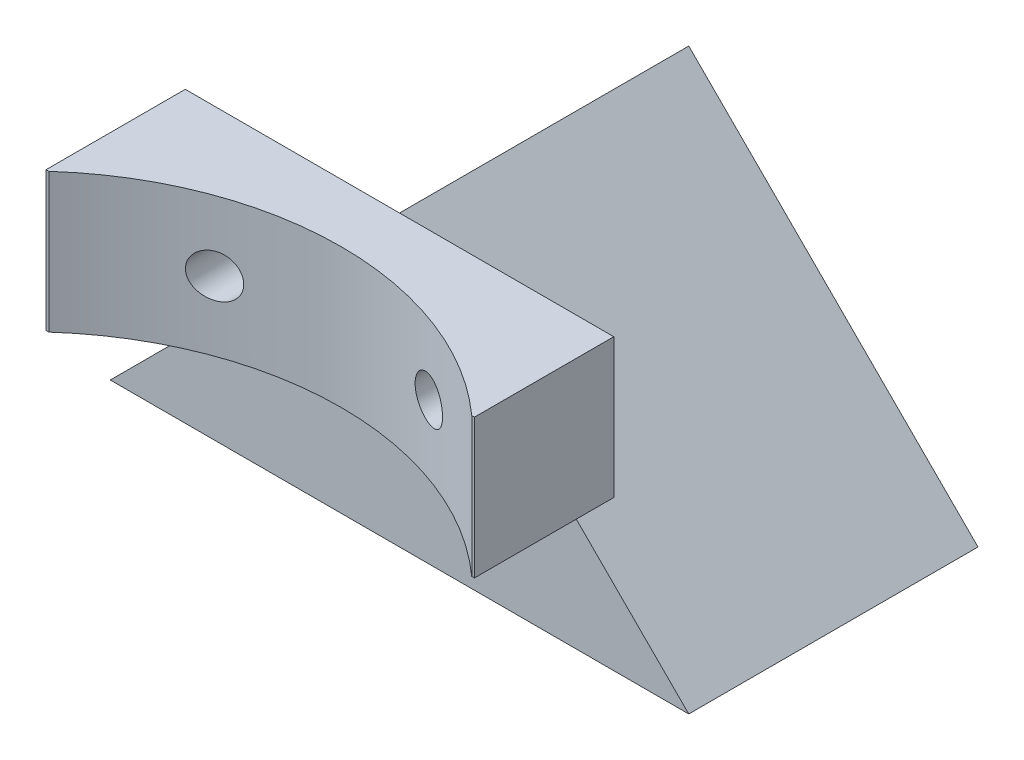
ISO-10303-21;
HEADER;
FILE_DESCRIPTION(('STEP AP214'),'2;1');
FILE_NAME('part.step','',(''),(''),'','','');
FILE_SCHEMA(('AUTOMOTIVE_DESIGN { 1 0 10303 214 1 1 1 1 }'));
ENDSEC;
DATA;
#1=APPLICATION_CONTEXT('core data for automotive mechanical design processes');
#2=APPLICATION_PROTOCOL_DEFINITION('international standard','automotive_design',2000,#1);
#3=PRODUCT_CONTEXT('',#1,'mechanical');
#4=PRODUCT('Part','Part','',(#3));
#5=PRODUCT_RELATED_PRODUCT_CATEGORY('part','',(#4));
#6=PRODUCT_DEFINITION_FORMATION('','',#4);
#7=PRODUCT_DEFINITION_CONTEXT('part definition',#1,'design');
#8=PRODUCT_DEFINITION('design','',#6,#7);
#9=PRODUCT_DEFINITION_SHAPE('','',#8);
#10=(LENGTH_UNIT() NAMED_UNIT(*) SI_UNIT(.MILLI.,.METRE.));
#11=(NAMED_UNIT(*) PLANE_ANGLE_UNIT() SI_UNIT($,.RADIAN.));
#12=(NAMED_UNIT(*) SI_UNIT($,.STERADIAN.) SOLID_ANGLE_UNIT());
#13=UNCERTAINTY_MEASURE_WITH_UNIT(LENGTH_MEASURE(1.E-05),#10,'distance_accuracy_value','');
#14=(GEOMETRIC_REPRESENTATION_CONTEXT(3) GLOBAL_UNCERTAINTY_ASSIGNED_CONTEXT((#13)) GLOBAL_UNIT_ASSIGNED_CONTEXT((#10,
#11,#12)) REPRESENTATION_CONTEXT('',''));
#15=CARTESIAN_POINT('',(0.,0.,0.));
#16=DIRECTION('',(0.,0.,1.));
#17=DIRECTION('',(1.,0.,0.));
#18=AXIS2_PLACEMENT_3D('',#15,#16,#17);
#19=CARTESIAN_POINT('',(0.,0.,40.));
#20=DIRECTION('',(0.,0.,1.));
#21=DIRECTION('',(1.,0.,0.));
#22=AXIS2_PLACEMENT_3D('',#19,#20,#21);
#23=PLANE('',#22);
#24=DIRECTION('',(0.,1.,0.));
#25=VECTOR('',#24,1.);
#26=CARTESIAN_POINT('',(15.9658598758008,-3.2664301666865,40.));
#27=LINE('',#26,#25);
#28=CARTESIAN_POINT('',(15.9658598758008,4.7335698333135,40.));
#29=VERTEX_POINT('',#28);
#30=CARTESIAN_POINT('',(15.9658598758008,17.7335698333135,40.));
#31=VERTEX_POINT('',#30);
#32=EDGE_CURVE('E122',#29,#31,#27,.T.);
#33=ORIENTED_EDGE('',*,*,#32,.F.);
#34=DIRECTION('',(1.,0.,0.));
#35=VECTOR('',#34,1.);
#36=CARTESIAN_POINT('',(-23.7773313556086,4.7335698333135,40.));
#37=LINE('',#36,#35);
#38=CARTESIAN_POINT('',(16.2226686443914,4.7335698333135,40.));
#39=VERTEX_POINT('',#38);
#40=EDGE_CURVE('E248',#29,#39,#37,.T.);
#41=ORIENTED_EDGE('',*,*,#40,.T.);
#42=DIRECTION('',(0.,1.,0.));
#43=VECTOR('',#42,1.);
#44=CARTESIAN_POINT('',(16.2226686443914,17.7335698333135,40.));
#45=LINE('',#44,#43);
#46=CARTESIAN_POINT('',(16.2226686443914,17.7335698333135,40.));
#47=VERTEX_POINT('',#46);
#48=EDGE_CURVE('E144',#39,#47,#45,.T.);
#49=ORIENTED_EDGE('',*,*,#48,.T.);
#50=DIRECTION('',(-1.,0.,0.));
#51=VECTOR('',#50,1.);
#52=CARTESIAN_POINT('',(-23.7773313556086,17.7335698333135,40.));
#53=LINE('',#52,#51);
#54=EDGE_CURVE('E138',#47,#31,#53,.T.);
#55=ORIENTED_EDGE('',*,*,#54,.T.);
#56=EDGE_LOOP('',(#33,#41,#49,#55));
#57=FACE_BOUND('',#56,.T.);
#58=ADVANCED_FACE('F39',(#57),#23,.T.);
#59=CARTESIAN_POINT('',(-30.7773313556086,-9.2664301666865,27.));
#60=DIRECTION('',(0.,1.,0.));
#61=DIRECTION('',(0.,0.,1.));
#62=AXIS2_PLACEMENT_3D('',#59,#60,#61);
#63=PLANE('',#62);
#64=DIRECTION('',(1.,0.,0.));
#65=VECTOR('',#64,1.);
#66=CARTESIAN_POINT('',(-30.7773313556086,-9.2664301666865,0.));
#67=LINE('',#66,#65);
#68=CARTESIAN_POINT('',(-30.7773313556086,-9.2664301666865,0.));
#69=VERTEX_POINT('',#68);
#70=CARTESIAN_POINT('',(23.2226686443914,-9.2664301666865,0.));
#71=VERTEX_POINT('',#70);
#72=EDGE_CURVE('E202',#69,#71,#67,.T.);
#73=ORIENTED_EDGE('',*,*,#72,.T.);
#74=DIRECTION('',(0.,0.,-1.));
#75=VECTOR('',#74,1.);
#76=CARTESIAN_POINT('',(23.2226686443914,-9.2664301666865,27.));
#77=LINE('',#76,#75);
#78=CARTESIAN_POINT('',(23.2226686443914,-9.2664301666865,27.));
#79=VERTEX_POINT('',#78);
#80=EDGE_CURVE('E207',#79,#71,#77,.T.);
#81=ORIENTED_EDGE('',*,*,#80,.F.);
#82=DIRECTION('',(1.,0.,0.));
#83=VECTOR('',#82,1.);
#84=CARTESIAN_POINT('',(-30.7773313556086,-9.2664301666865,27.));
#85=LINE('',#84,#83);
#86=CARTESIAN_POINT('',(-30.7773313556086,-9.2664301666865,27.));
#87=VERTEX_POINT('',#86);
#88=EDGE_CURVE('E203',#87,#79,#85,.T.);
#89=ORIENTED_EDGE('',*,*,#88,.F.);
#90=DIRECTION('',(0.,0.,-1.));
#91=VECTOR('',#90,1.);
#92=CARTESIAN_POINT('',(-30.7773313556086,-9.2664301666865,27.));
#93=LINE('',#92,#91);
#94=EDGE_CURVE('E54',#87,#69,#93,.T.);
#95=ORIENTED_EDGE('',*,*,#94,.T.);
#96=EDGE_LOOP('',(#73,#81,#89,#95));
#97=FACE_BOUND('',#96,.T.);
#98=ADVANCED_FACE('F41',(#97),#63,.F.);
#99=CARTESIAN_POINT('',(0.,0.,27.));
#100=DIRECTION('',(0.,0.,1.));
#101=DIRECTION('',(1.,0.,0.));
#102=AXIS2_PLACEMENT_3D('',#99,#100,#101);
#103=PLANE('',#102);
#104=DIRECTION('',(1.,0.,0.));
#105=VECTOR('',#104,1.);
#106=CARTESIAN_POINT('',(-23.7773313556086,4.7335698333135,27.));
#107=LINE('',#106,#105);
#108=CARTESIAN_POINT('',(-16.7773313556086,4.7335698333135,27.));
#109=VERTEX_POINT('',#108);
#110=CARTESIAN_POINT('',(9.22266864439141,4.7335698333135,27.));
#111=VERTEX_POINT('',#110);
#112=EDGE_CURVE('E11',#109,#111,#107,.T.);
#113=ORIENTED_EDGE('',*,*,#112,.F.);
#114=DIRECTION('',(-0.707106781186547,-0.707106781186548,0.));
#115=VECTOR('',#114,1.);
#116=CARTESIAN_POINT('',(-30.7773313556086,-9.2664301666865,27.));
#117=LINE('',#116,#115);
#118=EDGE_CURVE('E189',#109,#87,#117,.T.);
#119=ORIENTED_EDGE('',*,*,#118,.T.);
#120=ORIENTED_EDGE('',*,*,#88,.T.);
#121=DIRECTION('',(-0.707106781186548,0.707106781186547,0.));
#122=VECTOR('',#121,1.);
#123=CARTESIAN_POINT('',(23.2226686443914,-9.2664301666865,27.));
#124=LINE('',#123,#122);
#125=EDGE_CURVE('E192',#79,#111,#124,.T.);
#126=ORIENTED_EDGE('',*,*,#125,.T.);
#127=EDGE_LOOP('',(#113,#119,#120,#126));
#128=FACE_BOUND('',#127,.T.);
#129=ADVANCED_FACE('F231',(#128),#103,.T.);
#130=CARTESIAN_POINT('',(0.,0.,0.));
#131=DIRECTION('',(0.,0.,1.));
#132=DIRECTION('',(1.,0.,0.));
#133=AXIS2_PLACEMENT_3D('',#130,#131,#132);
#134=PLANE('',#133);
#135=ORIENTED_EDGE('',*,*,#72,.F.);
#136=DIRECTION('',(-0.707106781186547,-0.707106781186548,0.));
#137=VECTOR('',#136,1.);
#138=CARTESIAN_POINT('',(-30.7773313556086,-9.2664301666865,0.));
#139=LINE('',#138,#137);
#140=CARTESIAN_POINT('',(-3.7773313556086,17.7335698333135,0.));
#141=VERTEX_POINT('',#140);
#142=EDGE_CURVE('E183',#141,#69,#139,.T.);
#143=ORIENTED_EDGE('',*,*,#142,.F.);
#144=DIRECTION('',(-0.707106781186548,0.707106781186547,0.));
#145=VECTOR('',#144,1.);
#146=CARTESIAN_POINT('',(23.2226686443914,-9.2664301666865,0.));
#147=LINE('',#146,#145);
#148=EDGE_CURVE('E188',#71,#141,#147,.T.);
#149=ORIENTED_EDGE('',*,*,#148,.F.);
#150=EDGE_LOOP('',(#135,#143,#149));
#151=FACE_BOUND('',#150,.T.);
#152=ADVANCED_FACE('F225',(#151),#134,.F.);
#153=CARTESIAN_POINT('',(23.2226686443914,-9.2664301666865,27.));
#154=DIRECTION('',(-0.707106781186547,-0.707106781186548,0.));
#155=DIRECTION('',(0.707106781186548,-0.707106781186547,0.));
#156=AXIS2_PLACEMENT_3D('',#153,#154,#155);
#157=PLANE('',#156);
#158=ORIENTED_EDGE('',*,*,#148,.T.);
#159=DIRECTION('',(0.,0.,-1.));
#160=VECTOR('',#159,1.);
#161=CARTESIAN_POINT('',(-3.7773313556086,17.7335698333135,27.));
#162=LINE('',#161,#160);
#163=CARTESIAN_POINT('',(-3.7773313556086,17.7335698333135,27.));
#164=VERTEX_POINT('',#163);
#165=EDGE_CURVE('E195',#164,#141,#162,.T.);
#166=ORIENTED_EDGE('',*,*,#165,.F.);
#167=EDGE_CURVE('E196',#111,#164,#124,.T.);
#168=ORIENTED_EDGE('',*,*,#167,.F.);
#169=ORIENTED_EDGE('',*,*,#125,.F.);
#170=ORIENTED_EDGE('',*,*,#80,.T.);
#171=EDGE_LOOP('',(#158,#166,#168,#169,#170));
#172=FACE_BOUND('',#171,.T.);
#173=ADVANCED_FACE('F227',(#172),#157,.F.);
#174=CARTESIAN_POINT('',(-30.7773313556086,-9.2664301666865,27.));
#175=DIRECTION('',(0.707106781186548,-0.707106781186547,0.));
#176=DIRECTION('',(0.707106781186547,0.707106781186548,0.));
#177=AXIS2_PLACEMENT_3D('',#174,#175,#176);
#178=PLANE('',#177);
#179=ORIENTED_EDGE('',*,*,#142,.T.);
#180=ORIENTED_EDGE('',*,*,#94,.F.);
#181=ORIENTED_EDGE('',*,*,#118,.F.);
#182=EDGE_CURVE('E184',#164,#109,#117,.T.);
#183=ORIENTED_EDGE('',*,*,#182,.F.);
#184=ORIENTED_EDGE('',*,*,#165,.T.);
#185=EDGE_LOOP('',(#179,#180,#181,#183,#184));
#186=FACE_BOUND('',#185,.T.);
#187=ADVANCED_FACE('F220',(#186),#178,.F.);
#188=CARTESIAN_POINT('',(0.,0.,27.));
#189=DIRECTION('',(0.,0.,1.));
#190=DIRECTION('',(1.,0.,0.));
#191=AXIS2_PLACEMENT_3D('',#188,#189,#190);
#192=PLANE('',#191);
#193=CARTESIAN_POINT('',(-13.7773313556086,11.2335698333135,27.));
#194=DIRECTION('',(0.,0.,1.));
#195=DIRECTION('',(1.,0.,0.));
#196=AXIS2_PLACEMENT_3D('',#193,#194,#195);
#197=CIRCLE('',#196,2.);
#198=CARTESIAN_POINT('',(-11.7773313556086,11.2335698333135,27.));
#199=VERTEX_POINT('',#198);
#200=EDGE_CURVE('E131',#199,#199,#197,.T.);
#201=ORIENTED_EDGE('',*,*,#200,.T.);
#202=EDGE_LOOP('',(#201));
#203=FACE_BOUND('',#202,.T.);
#204=DIRECTION('',(-1.,0.,0.));
#205=VECTOR('',#204,1.);
#206=CARTESIAN_POINT('',(-23.7773313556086,17.7335698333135,27.));
#207=LINE('',#206,#205);
#208=CARTESIAN_POINT('',(-23.7773313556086,17.7335698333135,27.));
#209=VERTEX_POINT('',#208);
#210=EDGE_CURVE('E167',#164,#209,#207,.T.);
#211=ORIENTED_EDGE('',*,*,#210,.F.);
#212=ORIENTED_EDGE('',*,*,#182,.T.);
#213=CARTESIAN_POINT('',(-23.7773313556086,4.7335698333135,27.));
#214=VERTEX_POINT('',#213);
#215=EDGE_CURVE('E56',#214,#109,#107,.T.);
#216=ORIENTED_EDGE('',*,*,#215,.F.);
#217=DIRECTION('',(0.,-1.,0.));
#218=VECTOR('',#217,1.);
#219=CARTESIAN_POINT('',(-23.7773313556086,17.7335698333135,27.));
#220=LINE('',#219,#218);
#221=EDGE_CURVE('E157',#209,#214,#220,.T.);
#222=ORIENTED_EDGE('',*,*,#221,.F.);
#223=EDGE_LOOP('',(#211,#212,#216,#222));
#224=FACE_BOUND('',#223,.T.);
#225=ADVANCED_FACE('F241',(#203,#224),#192,.F.);
#226=CARTESIAN_POINT('',(6.22266864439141,11.2335698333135,27.));
#227=DIRECTION('',(0.,0.,1.));
#228=DIRECTION('',(1.,0.,0.));
#229=AXIS2_PLACEMENT_3D('',#226,#227,#228);
#230=CIRCLE('',#229,2.);
#231=CARTESIAN_POINT('',(8.2226686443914,11.2335698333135,27.));
#232=VERTEX_POINT('',#231);
#233=EDGE_CURVE('E160',#232,#232,#230,.T.);
#234=ORIENTED_EDGE('',*,*,#233,.T.);
#235=EDGE_LOOP('',(#234));
#236=FACE_BOUND('',#235,.T.);
#237=CARTESIAN_POINT('',(16.2226686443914,4.7335698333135,27.));
#238=VERTEX_POINT('',#237);
#239=EDGE_CURVE('E57',#111,#238,#107,.T.);
#240=ORIENTED_EDGE('',*,*,#239,.F.);
#241=ORIENTED_EDGE('',*,*,#167,.T.);
#242=CARTESIAN_POINT('',(16.2226686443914,17.7335698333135,27.));
#243=VERTEX_POINT('',#242);
#244=EDGE_CURVE('E168',#243,#164,#207,.T.);
#245=ORIENTED_EDGE('',*,*,#244,.F.);
#246=DIRECTION('',(0.,1.,0.));
#247=VECTOR('',#246,1.);
#248=CARTESIAN_POINT('',(16.2226686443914,17.7335698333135,27.));
#249=LINE('',#248,#247);
#250=EDGE_CURVE('E164',#238,#243,#249,.T.);
#251=ORIENTED_EDGE('',*,*,#250,.F.);
#252=EDGE_LOOP('',(#240,#241,#245,#251));
#253=FACE_BOUND('',#252,.T.);
#254=ADVANCED_FACE('F237',(#236,#253),#192,.F.);
#255=CARTESIAN_POINT('',(-23.7773313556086,17.7335698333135,40.));
#256=DIRECTION('',(1.,0.,0.));
#257=DIRECTION('',(0.,0.,-1.));
#258=AXIS2_PLACEMENT_3D('',#255,#256,#257);
#259=PLANE('',#258);
#260=ORIENTED_EDGE('',*,*,#221,.T.);
#261=DIRECTION('',(0.,0.,-1.));
#262=VECTOR('',#261,1.);
#263=CARTESIAN_POINT('',(-23.7773313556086,4.7335698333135,40.));
#264=LINE('',#263,#262);
#265=CARTESIAN_POINT('',(-23.7773313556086,4.7335698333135,40.));
#266=VERTEX_POINT('',#265);
#267=EDGE_CURVE('E179',#266,#214,#264,.T.);
#268=ORIENTED_EDGE('',*,*,#267,.F.);
#269=DIRECTION('',(0.,-1.,0.));
#270=VECTOR('',#269,1.);
#271=CARTESIAN_POINT('',(-23.7773313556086,17.7335698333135,40.));
#272=LINE('',#271,#270);
#273=CARTESIAN_POINT('',(-23.7773313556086,17.7335698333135,40.));
#274=VERTEX_POINT('',#273);
#275=EDGE_CURVE('E171',#274,#266,#272,.T.);
#276=ORIENTED_EDGE('',*,*,#275,.F.);
#277=DIRECTION('',(0.,0.,-1.));
#278=VECTOR('',#277,1.);
#279=CARTESIAN_POINT('',(-23.7773313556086,17.7335698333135,40.));
#280=LINE('',#279,#278);
#281=EDGE_CURVE('E147',#274,#209,#280,.T.);
#282=ORIENTED_EDGE('',*,*,#281,.T.);
#283=EDGE_LOOP('',(#260,#268,#276,#282));
#284=FACE_BOUND('',#283,.T.);
#285=ADVANCED_FACE('F288',(#284),#259,.F.);
#286=CARTESIAN_POINT('',(-23.7773313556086,4.7335698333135,40.));
#287=DIRECTION('',(0.,1.,0.));
#288=DIRECTION('',(0.,0.,1.));
#289=AXIS2_PLACEMENT_3D('',#286,#287,#288);
#290=PLANE('',#289);
#291=ORIENTED_EDGE('',*,*,#40,.F.);
#292=CARTESIAN_POINT('',(-3.77733135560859,4.7335698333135,62.));
#293=DIRECTION('',(0.,1.,0.));
#294=DIRECTION('',(0.,0.,1.));
#295=AXIS2_PLACEMENT_3D('',#292,#293,#294);
#296=CIRCLE('',#295,29.56);
#297=CARTESIAN_POINT('',(-23.520522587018,4.7335698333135,40.));
#298=VERTEX_POINT('',#297);
#299=EDGE_CURVE('E126',#29,#298,#296,.T.);
#300=ORIENTED_EDGE('',*,*,#299,.T.);
#301=EDGE_CURVE('E304',#266,#298,#37,.T.);
#302=ORIENTED_EDGE('',*,*,#301,.F.);
#303=ORIENTED_EDGE('',*,*,#267,.T.);
#304=ORIENTED_EDGE('',*,*,#215,.T.);
#305=ORIENTED_EDGE('',*,*,#112,.T.);
#306=ORIENTED_EDGE('',*,*,#239,.T.);
#307=DIRECTION('',(0.,0.,-1.));
#308=VECTOR('',#307,1.);
#309=CARTESIAN_POINT('',(16.2226686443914,4.7335698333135,40.));
#310=LINE('',#309,#308);
#311=EDGE_CURVE('E175',#39,#238,#310,.T.);
#312=ORIENTED_EDGE('',*,*,#311,.F.);
#313=EDGE_LOOP('',(#291,#300,#302,#303,#304,#305,#306,#312));
#314=FACE_BOUND('',#313,.T.);
#315=ADVANCED_FACE('F247',(#314),#290,.F.);
#316=CARTESIAN_POINT('',(16.2226686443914,17.7335698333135,40.));
#317=DIRECTION('',(-1.,0.,0.));
#318=DIRECTION('',(0.,0.,1.));
#319=AXIS2_PLACEMENT_3D('',#316,#317,#318);
#320=PLANE('',#319);
#321=ORIENTED_EDGE('',*,*,#250,.T.);
#322=DIRECTION('',(0.,0.,-1.));
#323=VECTOR('',#322,1.);
#324=CARTESIAN_POINT('',(16.2226686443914,17.7335698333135,40.));
#325=LINE('',#324,#323);
#326=EDGE_CURVE('E152',#47,#243,#325,.T.);
#327=ORIENTED_EDGE('',*,*,#326,.F.);
#328=ORIENTED_EDGE('',*,*,#48,.F.);
#329=ORIENTED_EDGE('',*,*,#311,.T.);
#330=EDGE_LOOP('',(#321,#327,#328,#329));
#331=FACE_BOUND('',#330,.T.);
#332=ADVANCED_FACE('F244',(#331),#320,.F.);
#333=CARTESIAN_POINT('',(-23.7773313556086,17.7335698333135,40.));
#334=DIRECTION('',(0.,-1.,0.));
#335=DIRECTION('',(0.,0.,-1.));
#336=AXIS2_PLACEMENT_3D('',#333,#334,#335);
#337=PLANE('',#336);
#338=CARTESIAN_POINT('',(-23.520522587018,17.7335698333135,40.));
#339=VERTEX_POINT('',#338);
#340=EDGE_CURVE('E140',#339,#274,#53,.T.);
#341=ORIENTED_EDGE('',*,*,#340,.F.);
#342=CARTESIAN_POINT('',(-3.77733135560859,17.7335698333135,62.));
#343=DIRECTION('',(0.,1.,0.));
#344=DIRECTION('',(0.,0.,1.));
#345=AXIS2_PLACEMENT_3D('',#342,#343,#344);
#346=CIRCLE('',#345,29.56);
#347=EDGE_CURVE('E64',#31,#339,#346,.T.);
#348=ORIENTED_EDGE('',*,*,#347,.F.);
#349=ORIENTED_EDGE('',*,*,#54,.F.);
#350=ORIENTED_EDGE('',*,*,#326,.T.);
#351=ORIENTED_EDGE('',*,*,#244,.T.);
#352=ORIENTED_EDGE('',*,*,#210,.T.);
#353=ORIENTED_EDGE('',*,*,#281,.F.);
#354=EDGE_LOOP('',(#341,#348,#349,#350,#351,#352,#353));
#355=FACE_BOUND('',#354,.T.);
#356=ADVANCED_FACE('F136',(#355),#337,.F.);
#357=DIRECTION('',(0.,1.,0.));
#358=VECTOR('',#357,1.);
#359=CARTESIAN_POINT('',(-23.520522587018,-3.2664301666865,40.));
#360=LINE('',#359,#358);
#361=EDGE_CURVE('E258',#339,#298,#360,.F.);
#362=ORIENTED_EDGE('',*,*,#361,.F.);
#363=ORIENTED_EDGE('',*,*,#340,.T.);
#364=ORIENTED_EDGE('',*,*,#275,.T.);
#365=ORIENTED_EDGE('',*,*,#301,.T.);
#366=EDGE_LOOP('',(#362,#363,#364,#365));
#367=FACE_BOUND('',#366,.T.);
#368=ADVANCED_FACE('F278',(#367),#23,.T.);
#369=CARTESIAN_POINT('',(-13.7773313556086,11.2335698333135,27.));
#370=DIRECTION('',(0.,0.,1.));
#371=DIRECTION('',(1.,0.,0.));
#372=AXIS2_PLACEMENT_3D('',#369,#370,#371);
#373=CYLINDRICAL_SURFACE('',#372,2.);
#374=CARTESIAN_POINT('',(-11.7773313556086,11.2335698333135,33.5431273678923));
#375=CARTESIAN_POINT('',(-11.7773366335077,11.3425881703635,33.5431282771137));
#376=CARTESIAN_POINT('',(-11.7862805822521,11.4516877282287,33.5456385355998));
#377=CARTESIAN_POINT('',(-11.8217762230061,11.6668365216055,33.5556537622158));
#378=CARTESIAN_POINT('',(-11.848349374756,11.7728818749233,33.5631648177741));
#379=CARTESIAN_POINT('',(-11.9181544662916,11.9787235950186,33.5830700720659));
#380=CARTESIAN_POINT('',(-11.9613679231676,12.0785267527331,33.595458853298));
#381=CARTESIAN_POINT('',(-12.0629795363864,12.2692708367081,33.6249331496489));
#382=CARTESIAN_POINT('',(-12.1213744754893,12.3602136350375,33.6420176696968));
#383=CARTESIAN_POINT('',(-12.2523242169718,12.5321002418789,33.6808755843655));
#384=CARTESIAN_POINT('',(-12.3250579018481,12.6128941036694,33.7027086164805));
#385=CARTESIAN_POINT('',(-12.4818673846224,12.761123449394,33.7505511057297));
#386=CARTESIAN_POINT('',(-12.5659450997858,12.8285566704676,33.7765612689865));
#387=CARTESIAN_POINT('',(-12.7460935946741,12.9507804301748,33.8332799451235));
#388=CARTESIAN_POINT('',(-12.8424843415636,13.0050366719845,33.8641225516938));
#389=CARTESIAN_POINT('',(-13.0419119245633,13.0966882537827,33.9291583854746));
#390=CARTESIAN_POINT('',(-13.1449501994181,13.1340799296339,33.9633523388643));
#391=CARTESIAN_POINT('',(-13.3598400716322,13.192825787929,34.0360486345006));
#392=CARTESIAN_POINT('',(-13.4718781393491,13.2133404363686,34.0746781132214));
#393=CARTESIAN_POINT('',(-13.69712627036,13.2351642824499,34.1538955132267));
#394=CARTESIAN_POINT('',(-13.8103366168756,13.2364687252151,34.1944839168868));
#395=CARTESIAN_POINT('',(-14.0400494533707,13.2197275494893,34.2784232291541));
#396=CARTESIAN_POINT('',(-14.1564739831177,13.2008174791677,34.3218166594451));
#397=CARTESIAN_POINT('',(-14.3843258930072,13.1428584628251,34.4083321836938));
#398=CARTESIAN_POINT('',(-14.4957522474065,13.1038054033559,34.4514542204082));
#399=CARTESIAN_POINT('',(-14.7124901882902,13.0055421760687,34.5367571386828));
#400=CARTESIAN_POINT('',(-14.8176563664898,12.9459832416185,34.5789072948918));
#401=CARTESIAN_POINT('',(-15.0164369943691,12.8081300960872,34.659779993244));
#402=CARTESIAN_POINT('',(-15.1100522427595,12.7298371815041,34.6985027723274));
#403=CARTESIAN_POINT('',(-15.2797236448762,12.5590303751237,34.7695615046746));
#404=CARTESIAN_POINT('',(-15.3562418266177,12.4670451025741,34.8020608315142));
#405=CARTESIAN_POINT('',(-15.4923639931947,12.2694422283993,34.8604142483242));
#406=CARTESIAN_POINT('',(-15.5519774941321,12.1638323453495,34.8862720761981));
#407=CARTESIAN_POINT('',(-15.6477286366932,11.9506519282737,34.9280625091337));
#408=CARTESIAN_POINT('',(-15.6853155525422,11.8438522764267,34.9446040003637));
#409=CARTESIAN_POINT('',(-15.7420011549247,11.6245621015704,34.9696234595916));
#410=CARTESIAN_POINT('',(-15.7611103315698,11.5120748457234,34.9781060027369));
#411=CARTESIAN_POINT('',(-15.7792009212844,11.2937042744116,34.9861367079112));
#412=CARTESIAN_POINT('',(-15.7795828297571,11.1879574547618,34.9863065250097));
#413=CARTESIAN_POINT('',(-15.7637234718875,10.9779807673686,34.9792657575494));
#414=CARTESIAN_POINT('',(-15.7474847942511,10.8737506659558,34.9720563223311));
#415=CARTESIAN_POINT('',(-15.6996080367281,10.6719811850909,34.9509043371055));
#416=CARTESIAN_POINT('',(-15.6683019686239,10.5743470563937,34.9371070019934));
#417=CARTESIAN_POINT('',(-15.5916506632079,10.3858663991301,34.9035574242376));
#418=CARTESIAN_POINT('',(-15.5463033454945,10.2950208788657,34.8838042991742));
#419=CARTESIAN_POINT('',(-15.4409033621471,10.1184245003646,34.838297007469));
#420=CARTESIAN_POINT('',(-15.3803056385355,10.0330566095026,34.8123226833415));
#421=CARTESIAN_POINT('',(-15.2474494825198,9.8735942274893,34.7560063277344));
#422=CARTESIAN_POINT('',(-15.175187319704,9.79950335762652,34.7256628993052));
#423=CARTESIAN_POINT('',(-15.0150111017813,9.65864747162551,34.6592571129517));
#424=CARTESIAN_POINT('',(-14.9263193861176,9.59288960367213,34.6229340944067));
#425=CARTESIAN_POINT('',(-14.7401233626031,9.47713583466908,34.5478439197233));
#426=CARTESIAN_POINT('',(-14.6426159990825,9.4271454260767,34.5090759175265));
#427=CARTESIAN_POINT('',(-14.4341753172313,9.34091583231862,34.4275748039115));
#428=CARTESIAN_POINT('',(-14.3227798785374,9.3058735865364,34.3847533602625));
#429=CARTESIAN_POINT('',(-14.0956018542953,9.2556304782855,34.299067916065));
#430=CARTESIAN_POINT('',(-13.9798183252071,9.24043390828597,34.2562039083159));
#431=CARTESIAN_POINT('',(-13.7436034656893,9.23026596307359,34.170461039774));
#432=CARTESIAN_POINT('',(-13.6231335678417,9.23588171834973,34.1276163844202));
#433=CARTESIAN_POINT('',(-13.3843160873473,9.26886500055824,34.0444024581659));
#434=CARTESIAN_POINT('',(-13.2659683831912,9.29623127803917,34.0040330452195));
#435=CARTESIAN_POINT('',(-13.0373571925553,9.37167677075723,33.9275975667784));
#436=CARTESIAN_POINT('',(-12.9269819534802,9.4193472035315,33.891463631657));
#437=CARTESIAN_POINT('',(-12.7155680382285,9.53441446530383,33.8235229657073));
#438=CARTESIAN_POINT('',(-12.6145265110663,9.60180524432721,33.7917149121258));
#439=CARTESIAN_POINT('',(-12.4299037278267,9.75105038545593,33.734552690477));
#440=CARTESIAN_POINT('',(-12.3457251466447,9.8320763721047,33.7089655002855));
#441=CARTESIAN_POINT('',(-12.19218883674,10.0084253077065,33.6629180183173));
#442=CARTESIAN_POINT('',(-12.1228307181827,10.1037478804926,33.6424575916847));
#443=CARTESIAN_POINT('',(-12.0044674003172,10.301062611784,33.6078978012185));
#444=CARTESIAN_POINT('',(-11.9546563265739,10.4025279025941,33.5935438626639));
#445=CARTESIAN_POINT('',(-11.8727609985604,10.612839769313,33.5700957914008));
#446=CARTESIAN_POINT('',(-11.8406502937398,10.7216750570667,33.5609938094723));
#447=CARTESIAN_POINT('',(-11.8044684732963,10.8983822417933,33.5507671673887));
#448=CARTESIAN_POINT('',(-11.7943073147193,10.9649699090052,33.5479043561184));
#449=CARTESIAN_POINT('',(-11.7807371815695,11.0988846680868,33.5440841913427));
#450=CARTESIAN_POINT('',(-11.7773280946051,11.1662117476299,33.5431268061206));
#451=CARTESIAN_POINT('',(-11.7773313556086,11.2335698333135,33.5431273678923));
#452=B_SPLINE_CURVE_WITH_KNOTS('',3,(#374,#375,#376,#377,#378,#379,#380,#381,#382,#383,#384,
#385,#386,#387,#388,#389,#390,#391,#392,#393,#394,#395,#396,#397,#398,#399,#400,#401,#402,#403,
#404,#405,#406,#407,#408,#409,#410,#411,#412,#413,#414,#415,#416,#417,#418,#419,#420,#421,#422,
#423,#424,#425,#426,#427,#428,#429,#430,#431,#432,#433,#434,#435,#436,#437,#438,#439,#440,#441,
#442,#443,#444,#445,#446,#447,#448,#449,#450,#451),.UNSPECIFIED.,.T.,.F.,(4,2,2,2,2,2,2,2,2,2,2,
2,2,2,2,2,2,2,2,2,2,2,2,2,2,2,2,2,2,2,2,2,2,2,2,2,2,2,4),(0.,0.326804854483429,
0.654008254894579,0.980849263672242,1.30762106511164,1.63876189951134,1.96995877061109,
2.3129226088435,2.65596092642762,3.01517770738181,3.37448339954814,3.74979279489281,
4.12517886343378,4.50729369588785,4.88938209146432,5.25937544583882,5.62916010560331,
5.97059839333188,6.31184272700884,6.62752531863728,6.94315874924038,7.2521351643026,
7.56115738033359,7.88336973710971,8.20568534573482,8.55288410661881,8.90020367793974,
9.27165798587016,9.6431926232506,10.0252872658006,10.4073599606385,10.7820792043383,
11.1566836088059,11.5136866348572,11.8706802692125,12.2108306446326,12.5504713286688,
12.7523943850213,12.9543140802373),.UNSPECIFIED.);
#453=CARTESIAN_POINT('',(-11.7773313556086,11.2335698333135,33.5431273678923));
#454=VERTEX_POINT('',#453);
#455=EDGE_CURVE('E261',#454,#454,#452,.T.);
#456=ORIENTED_EDGE('',*,*,#455,.T.);
#457=EDGE_LOOP('',(#456));
#458=FACE_BOUND('',#457,.T.);
#459=ORIENTED_EDGE('',*,*,#200,.F.);
#460=EDGE_LOOP('',(#459));
#461=FACE_BOUND('',#460,.T.);
#462=ADVANCED_FACE('F275',(#458,#461),#373,.F.);
#463=CARTESIAN_POINT('',(6.22266864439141,11.2335698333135,27.));
#464=DIRECTION('',(0.,0.,1.));
#465=DIRECTION('',(1.,0.,0.));
#466=AXIS2_PLACEMENT_3D('',#463,#464,#465);
#467=CYLINDRICAL_SURFACE('',#466,2.);
#468=CARTESIAN_POINT('',(8.2226686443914,11.2335698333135,34.9853077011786));
#469=CARTESIAN_POINT('',(8.22266283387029,11.3391471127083,34.9853045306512));
#470=CARTESIAN_POINT('',(8.2142676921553,11.4448068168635,34.9815711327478));
#471=CARTESIAN_POINT('',(8.18102901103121,11.6530631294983,34.9668438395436));
#472=CARTESIAN_POINT('',(8.15616446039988,11.7556556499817,34.9558406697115));
#473=CARTESIAN_POINT('',(8.09110899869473,11.9545775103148,34.927228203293));
#474=CARTESIAN_POINT('',(8.05095635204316,12.0509217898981,34.9096354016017));
#475=CARTESIAN_POINT('',(7.95684649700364,12.2352393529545,34.8687396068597));
#476=CARTESIAN_POINT('',(7.90289016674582,12.3232131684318,34.8454369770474));
#477=CARTESIAN_POINT('',(7.78057952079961,12.4922268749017,34.7931464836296));
#478=CARTESIAN_POINT('',(7.7117431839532,12.5728590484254,34.7639713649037));
#479=CARTESIAN_POINT('',(7.56314618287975,12.721582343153,34.7017646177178));
#480=CARTESIAN_POINT('',(7.48338191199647,12.7896693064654,34.6687317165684));
#481=CARTESIAN_POINT('',(7.30826449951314,12.9170539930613,34.5972119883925));
#482=CARTESIAN_POINT('',(7.2121748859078,12.9752138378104,34.5585002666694));
#483=CARTESIAN_POINT('',(7.01224514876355,13.0745037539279,34.4792767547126));
#484=CARTESIAN_POINT('',(6.90840239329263,13.1156280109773,34.4387643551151));
#485=CARTESIAN_POINT('',(6.68911182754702,13.1819858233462,34.354715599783));
#486=CARTESIAN_POINT('',(6.57334168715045,13.2061145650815,34.3111439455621));
#487=CARTESIAN_POINT('',(6.33909055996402,13.23365927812,34.2247016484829));
#488=CARTESIAN_POINT('',(6.22060919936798,13.2370723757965,34.1818311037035));
#489=CARTESIAN_POINT('',(5.98255291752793,13.2227297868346,34.0974118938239));
#490=CARTESIAN_POINT('',(5.86298592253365,13.2046769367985,34.0558901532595));
#491=CARTESIAN_POINT('',(5.62808347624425,13.1469669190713,33.9759538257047));
#492=CARTESIAN_POINT('',(5.51274746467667,13.1073126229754,33.9375388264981));
#493=CARTESIAN_POINT('',(5.29348090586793,13.0085713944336,33.8659124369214));
#494=CARTESIAN_POINT('',(5.18931196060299,12.9501033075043,33.8325794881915));
#495=CARTESIAN_POINT('',(4.99214635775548,12.8147404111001,33.7705729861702));
#496=CARTESIAN_POINT('',(4.89914643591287,12.7378510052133,33.7418980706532));
#497=CARTESIAN_POINT('',(4.73203608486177,12.5719226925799,33.6911403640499));
#498=CARTESIAN_POINT('',(4.65721778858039,12.4836750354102,33.6688012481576));
#499=CARTESIAN_POINT('',(4.52350844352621,12.2948094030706,33.6293367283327));
#500=CARTESIAN_POINT('',(4.46461306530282,12.1941948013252,33.6122099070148));
#501=CARTESIAN_POINT('',(4.36719328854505,11.9882933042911,33.5841103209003));
#502=CARTESIAN_POINT('',(4.32788208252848,11.883410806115,33.5728985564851));
#503=CARTESIAN_POINT('',(4.26725953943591,11.6681611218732,33.5556831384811));
#504=CARTESIAN_POINT('',(4.24594502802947,11.5577949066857,33.5496785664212));
#505=CARTESIAN_POINT('',(4.22241438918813,11.337895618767,33.5430533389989));
#506=CARTESIAN_POINT('',(4.2197010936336,11.2284196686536,33.5422925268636));
#507=CARTESIAN_POINT('',(4.23214775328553,11.0105751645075,33.5457931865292));
#508=CARTESIAN_POINT('',(4.24730641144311,10.9022065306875,33.5500542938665));
#509=CARTESIAN_POINT('',(4.29479399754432,10.6904376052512,33.5634919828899));
#510=CARTESIAN_POINT('',(4.32700025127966,10.5870075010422,33.572633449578));
#511=CARTESIAN_POINT('',(4.40740974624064,10.3871423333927,33.5956807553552));
#512=CARTESIAN_POINT('',(4.45561335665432,10.2907074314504,33.6095867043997));
#513=CARTESIAN_POINT('',(4.56709304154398,10.1062632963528,33.6421513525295));
#514=CARTESIAN_POINT('',(4.630542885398,10.0183689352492,33.6608650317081));
#515=CARTESIAN_POINT('',(4.77014190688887,9.85452880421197,33.702657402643));
#516=CARTESIAN_POINT('',(4.84629253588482,9.77858440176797,33.7257365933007));
#517=CARTESIAN_POINT('',(5.01141169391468,9.63828226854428,33.7766184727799));
#518=CARTESIAN_POINT('',(5.10069652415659,9.57434107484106,33.8045422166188));
#519=CARTESIAN_POINT('',(5.28756991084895,9.46227975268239,33.8640660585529));
#520=CARTESIAN_POINT('',(5.38516006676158,9.41416268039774,33.8956668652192));
#521=CARTESIAN_POINT('',(5.5903788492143,9.33280017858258,33.9633850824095));
#522=CARTESIAN_POINT('',(5.69826072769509,9.30030892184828,33.9996406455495));
#523=CARTESIAN_POINT('',(5.91710035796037,9.25388562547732,34.074653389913));
#524=CARTESIAN_POINT('',(6.0280588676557,9.23995820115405,34.1134111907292));
#525=CARTESIAN_POINT('',(6.25548805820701,9.23045134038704,34.1944002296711));
#526=CARTESIAN_POINT('',(6.37196938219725,9.23577811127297,34.2367089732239));
#527=CARTESIAN_POINT('',(6.60206090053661,9.26645503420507,34.3219060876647));
#528=CARTESIAN_POINT('',(6.71567042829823,9.29180979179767,34.3647945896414));
#529=CARTESIAN_POINT('',(6.94034986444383,9.36294761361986,34.4511376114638));
#530=CARTESIAN_POINT('',(7.0512429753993,9.40931738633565,34.4945708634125));
#531=CARTESIAN_POINT('',(7.26364235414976,9.5216110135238,34.5791397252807));
#532=CARTESIAN_POINT('',(7.36514835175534,9.58753543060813,34.6202752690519));
#533=CARTESIAN_POINT('',(7.55424373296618,9.7365077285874,34.6979977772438));
#534=CARTESIAN_POINT('',(7.64200542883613,9.81930744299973,34.7346395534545));
#535=CARTESIAN_POINT('',(7.802120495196,10.0007079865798,34.8022525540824));
#536=CARTESIAN_POINT('',(7.87447605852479,10.0993065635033,34.8332245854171));
#537=CARTESIAN_POINT('',(7.9965959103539,10.3027900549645,34.8859374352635));
#538=CARTESIAN_POINT('',(8.04751564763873,10.4068602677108,34.9081445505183));
#539=CARTESIAN_POINT('',(8.13081201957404,10.6233441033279,34.9446526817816));
#540=CARTESIAN_POINT('',(8.16322687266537,10.7357399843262,34.9589699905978));
#541=CARTESIAN_POINT('',(8.19790599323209,10.9133024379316,34.9743186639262));
#542=CARTESIAN_POINT('',(8.20717474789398,10.9769205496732,34.9784297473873));
#543=CARTESIAN_POINT('',(8.21955774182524,11.1048721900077,34.9839251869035));
#544=CARTESIAN_POINT('',(8.22267218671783,11.1692056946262,34.9853096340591));
#545=CARTESIAN_POINT('',(8.2226686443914,11.2335698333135,34.9853077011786));
#546=B_SPLINE_CURVE_WITH_KNOTS('',3,(#468,#469,#470,#471,#472,#473,#474,#475,#476,#477,#478,
#479,#480,#481,#482,#483,#484,#485,#486,#487,#488,#489,#490,#491,#492,#493,#494,#495,#496,#497,
#498,#499,#500,#501,#502,#503,#504,#505,#506,#507,#508,#509,#510,#511,#512,#513,#514,#515,#516,
#517,#518,#519,#520,#521,#522,#523,#524,#525,#526,#527,#528,#529,#530,#531,#532,#533,#534,#535,
#536,#537,#538,#539,#540,#541,#542,#543,#544,#545),.UNSPECIFIED.,.T.,.F.,(4,2,2,2,2,2,2,2,2,2,2,
2,2,2,2,2,2,2,2,2,2,2,2,2,2,2,2,2,2,2,2,2,2,2,2,2,2,2,4),(0.,0.316483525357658,
0.633371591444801,0.949471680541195,1.26555166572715,1.59403851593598,1.92263404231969,
2.2775002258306,2.63248742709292,3.00883050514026,3.38522578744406,3.76689293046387,
4.14850934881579,4.51867416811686,4.88873053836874,5.24044195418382,5.59205764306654,
5.92809780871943,6.26407868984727,6.59104330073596,6.91798418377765,7.24260376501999,
7.56723083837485,7.89574973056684,8.22430618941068,8.56273128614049,8.90122170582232,
9.25472369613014,9.60831355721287,9.97875742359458,10.349286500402,10.7308663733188,
11.1124572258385,11.4887960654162,11.8650813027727,12.2171151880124,12.568419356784,
12.7613668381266,12.9543078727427),.UNSPECIFIED.);
#547=CARTESIAN_POINT('',(8.2226686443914,11.2335698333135,34.9853077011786));
#548=VERTEX_POINT('',#547);
#549=EDGE_CURVE('E43',#548,#548,#546,.T.);
#550=ORIENTED_EDGE('',*,*,#549,.T.);
#551=EDGE_LOOP('',(#550));
#552=FACE_BOUND('',#551,.T.);
#553=ORIENTED_EDGE('',*,*,#233,.F.);
#554=EDGE_LOOP('',(#553));
#555=FACE_BOUND('',#554,.T.);
#556=ADVANCED_FACE('F269',(#552,#555),#467,.F.);
#557=CARTESIAN_POINT('',(-3.77733135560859,-3.2664301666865,62.));
#558=DIRECTION('',(0.,1.,0.));
#559=DIRECTION('',(0.,0.,1.));
#560=AXIS2_PLACEMENT_3D('',#557,#558,#559);
#561=CYLINDRICAL_SURFACE('',#560,29.56);
#562=ORIENTED_EDGE('',*,*,#32,.T.);
#563=ORIENTED_EDGE('',*,*,#347,.T.);
#564=ORIENTED_EDGE('',*,*,#361,.T.);
#565=ORIENTED_EDGE('',*,*,#299,.F.);
#566=EDGE_LOOP('',(#562,#563,#564,#565));
#567=FACE_BOUND('',#566,.T.);
#568=ORIENTED_EDGE('',*,*,#549,.F.);
#569=EDGE_LOOP('',(#568));
#570=FACE_BOUND('',#569,.T.);
#571=ORIENTED_EDGE('',*,*,#455,.F.);
#572=EDGE_LOOP('',(#571));
#573=FACE_BOUND('',#572,.T.);
#574=ADVANCED_FACE('F123',(#567,#570,#573),#561,.F.);
#575=CLOSED_SHELL('',(#58,#98,#129,#152,#173,#187,#225,#254,#285,#315,#332,#356,#368,#462,#556,#574));
#576=MANIFOLD_SOLID_BREP('B2',#575);
#577=ADVANCED_BREP_SHAPE_REPRESENTATION('',(#18,#576),#14);
#578=SHAPE_DEFINITION_REPRESENTATION(#9,#577);
ENDSEC;
END-ISO-10303-21;
